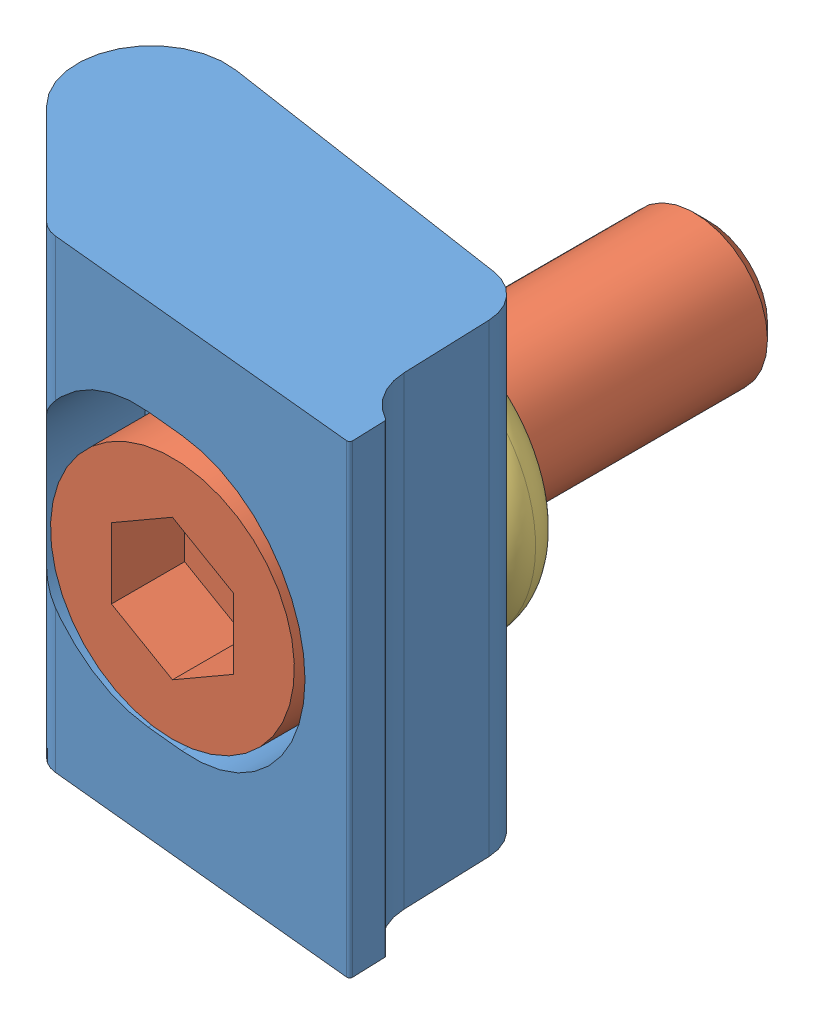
SolidWorks assembly MBSC06TC.sldasm, configuration Default (file format 15000). Lengths in mm.
Overall size (19.04 19.05 22.35).
3 component instances, 3 part files, 0 mates.
Components (placement in the parent):
- MBSC06TC_01-1: MBSC06TC_01.SLDPRT [ﾃﾞﾌｫﾙﾄ] at origin size (19.04 19.05 10.92)
- MBSC06TC_02-1: MBSC06TC_02.SLDPRT [ﾃﾞﾌｫﾙﾄ] at (0 0 4.572) size (10 10 22)
- MBSC06TC_03-1: MBSC06TC_03.SLDPRT [ﾃﾞﾌｫﾙﾄ] at origin size (11.18 11.18 2.54)
